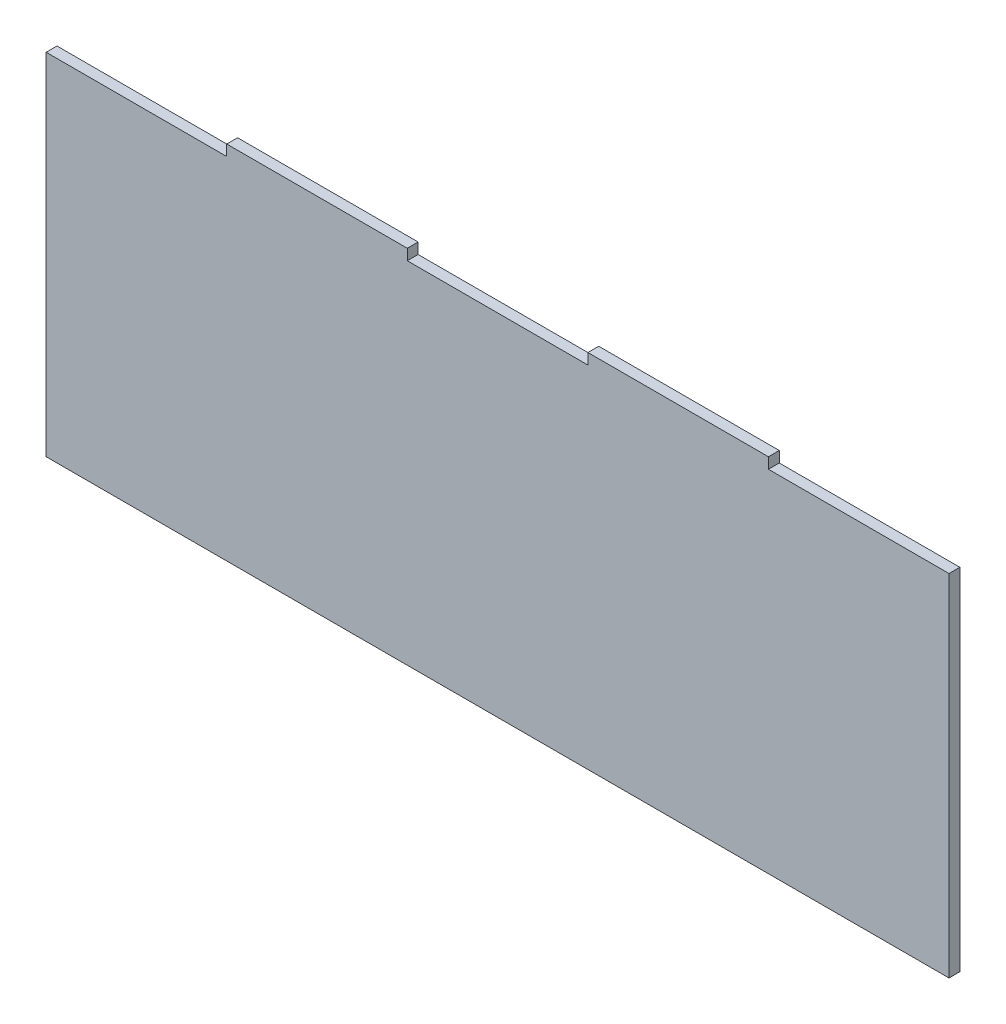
ISO-10303-21;
HEADER;
FILE_DESCRIPTION(('STEP AP214'),'2;1');
FILE_NAME('part.step','',(''),(''),'','','');
FILE_SCHEMA(('AUTOMOTIVE_DESIGN { 1 0 10303 214 1 1 1 1 }'));
ENDSEC;
DATA;
#1=APPLICATION_CONTEXT('core data for automotive mechanical design processes');
#2=APPLICATION_PROTOCOL_DEFINITION('international standard','automotive_design',2000,#1);
#3=PRODUCT_CONTEXT('',#1,'mechanical');
#4=PRODUCT('Part','Part','',(#3));
#5=PRODUCT_RELATED_PRODUCT_CATEGORY('part','',(#4));
#6=PRODUCT_DEFINITION_FORMATION('','',#4);
#7=PRODUCT_DEFINITION_CONTEXT('part definition',#1,'design');
#8=PRODUCT_DEFINITION('design','',#6,#7);
#9=PRODUCT_DEFINITION_SHAPE('','',#8);
#10=(LENGTH_UNIT() NAMED_UNIT(*) SI_UNIT(.MILLI.,.METRE.));
#11=(NAMED_UNIT(*) PLANE_ANGLE_UNIT() SI_UNIT($,.RADIAN.));
#12=(NAMED_UNIT(*) SI_UNIT($,.STERADIAN.) SOLID_ANGLE_UNIT());
#13=UNCERTAINTY_MEASURE_WITH_UNIT(LENGTH_MEASURE(1.E-05),#10,'distance_accuracy_value','');
#14=(GEOMETRIC_REPRESENTATION_CONTEXT(3) GLOBAL_UNCERTAINTY_ASSIGNED_CONTEXT((#13)) GLOBAL_UNIT_ASSIGNED_CONTEXT((#10,
#11,#12)) REPRESENTATION_CONTEXT('',''));
#15=CARTESIAN_POINT('',(0.,0.,0.));
#16=DIRECTION('',(0.,0.,1.));
#17=DIRECTION('',(1.,0.,0.));
#18=AXIS2_PLACEMENT_3D('',#15,#16,#17);
#19=CARTESIAN_POINT('',(-116.914191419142,267.927392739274,6.));
#20=DIRECTION('',(0.,1.,0.));
#21=DIRECTION('',(0.,0.,1.));
#22=AXIS2_PLACEMENT_3D('',#19,#20,#21);
#23=PLANE('',#22);
#24=DIRECTION('',(1.,0.,0.));
#25=VECTOR('',#24,1.);
#26=CARTESIAN_POINT('',(-116.914191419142,267.927392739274,0.));
#27=LINE('',#26,#25);
#28=CARTESIAN_POINT('',(-116.914191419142,267.927392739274,0.));
#29=VERTEX_POINT('',#28);
#30=CARTESIAN_POINT('',(-16.914191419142,267.927392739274,0.));
#31=VERTEX_POINT('',#30);
#32=EDGE_CURVE('E152',#29,#31,#27,.T.);
#33=ORIENTED_EDGE('',*,*,#32,.F.);
#34=DIRECTION('',(0.,0.,-1.));
#35=VECTOR('',#34,1.);
#36=CARTESIAN_POINT('',(-116.914191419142,267.927392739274,6.));
#37=LINE('',#36,#35);
#38=CARTESIAN_POINT('',(-116.914191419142,267.927392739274,6.));
#39=VERTEX_POINT('',#38);
#40=EDGE_CURVE('E11',#39,#29,#37,.T.);
#41=ORIENTED_EDGE('',*,*,#40,.F.);
#42=DIRECTION('',(1.,0.,0.));
#43=VECTOR('',#42,1.);
#44=CARTESIAN_POINT('',(-116.914191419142,267.927392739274,6.));
#45=LINE('',#44,#43);
#46=CARTESIAN_POINT('',(-16.914191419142,267.927392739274,6.));
#47=VERTEX_POINT('',#46);
#48=EDGE_CURVE('E183',#39,#47,#45,.T.);
#49=ORIENTED_EDGE('',*,*,#48,.T.);
#50=DIRECTION('',(0.,0.,-1.));
#51=VECTOR('',#50,1.);
#52=CARTESIAN_POINT('',(-16.914191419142,267.927392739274,6.));
#53=LINE('',#52,#51);
#54=EDGE_CURVE('E36',#47,#31,#53,.T.);
#55=ORIENTED_EDGE('',*,*,#54,.T.);
#56=EDGE_LOOP('',(#33,#41,#49,#55));
#57=FACE_BOUND('',#56,.T.);
#58=ADVANCED_FACE('F33',(#57),#23,.T.);
#59=CARTESIAN_POINT('',(-116.914191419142,273.927392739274,6.));
#60=DIRECTION('',(1.,0.,0.));
#61=DIRECTION('',(0.,1.,0.));
#62=AXIS2_PLACEMENT_3D('',#59,#60,#61);
#63=PLANE('',#62);
#64=DIRECTION('',(0.,-1.,0.));
#65=VECTOR('',#64,1.);
#66=CARTESIAN_POINT('',(-116.914191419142,273.927392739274,0.));
#67=LINE('',#66,#65);
#68=CARTESIAN_POINT('',(-116.914191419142,273.927392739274,0.));
#69=VERTEX_POINT('',#68);
#70=EDGE_CURVE('E181',#69,#29,#67,.T.);
#71=ORIENTED_EDGE('',*,*,#70,.F.);
#72=DIRECTION('',(0.,0.,-1.));
#73=VECTOR('',#72,1.);
#74=CARTESIAN_POINT('',(-116.914191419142,273.927392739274,6.));
#75=LINE('',#74,#73);
#76=CARTESIAN_POINT('',(-116.914191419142,273.927392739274,6.));
#77=VERTEX_POINT('',#76);
#78=EDGE_CURVE('E42',#77,#69,#75,.T.);
#79=ORIENTED_EDGE('',*,*,#78,.F.);
#80=DIRECTION('',(0.,-1.,0.));
#81=VECTOR('',#80,1.);
#82=CARTESIAN_POINT('',(-116.914191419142,273.927392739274,6.));
#83=LINE('',#82,#81);
#84=EDGE_CURVE('E147',#77,#39,#83,.T.);
#85=ORIENTED_EDGE('',*,*,#84,.T.);
#86=ORIENTED_EDGE('',*,*,#40,.T.);
#87=EDGE_LOOP('',(#71,#79,#85,#86));
#88=FACE_BOUND('',#87,.T.);
#89=ADVANCED_FACE('F205',(#88),#63,.T.);
#90=CARTESIAN_POINT('',(-216.914191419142,273.927392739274,6.));
#91=DIRECTION('',(0.,1.,0.));
#92=DIRECTION('',(0.,0.,1.));
#93=AXIS2_PLACEMENT_3D('',#90,#91,#92);
#94=PLANE('',#93);
#95=DIRECTION('',(1.,0.,0.));
#96=VECTOR('',#95,1.);
#97=CARTESIAN_POINT('',(-216.914191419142,273.927392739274,0.));
#98=LINE('',#97,#96);
#99=CARTESIAN_POINT('',(-216.914191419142,273.927392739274,0.));
#100=VERTEX_POINT('',#99);
#101=EDGE_CURVE('E132',#100,#69,#98,.T.);
#102=ORIENTED_EDGE('',*,*,#101,.F.);
#103=DIRECTION('',(0.,0.,-1.));
#104=VECTOR('',#103,1.);
#105=CARTESIAN_POINT('',(-216.914191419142,273.927392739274,6.));
#106=LINE('',#105,#104);
#107=CARTESIAN_POINT('',(-216.914191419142,273.927392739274,6.));
#108=VERTEX_POINT('',#107);
#109=EDGE_CURVE('E126',#108,#100,#106,.T.);
#110=ORIENTED_EDGE('',*,*,#109,.F.);
#111=DIRECTION('',(1.,0.,0.));
#112=VECTOR('',#111,1.);
#113=CARTESIAN_POINT('',(-216.914191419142,273.927392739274,6.));
#114=LINE('',#113,#112);
#115=EDGE_CURVE('E130',#108,#77,#114,.T.);
#116=ORIENTED_EDGE('',*,*,#115,.T.);
#117=ORIENTED_EDGE('',*,*,#78,.T.);
#118=EDGE_LOOP('',(#102,#110,#116,#117));
#119=FACE_BOUND('',#118,.T.);
#120=ADVANCED_FACE('F128',(#119),#94,.T.);
#121=CARTESIAN_POINT('',(-216.914191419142,273.927392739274,6.));
#122=DIRECTION('',(1.,0.,0.));
#123=DIRECTION('',(0.,0.,-1.));
#124=AXIS2_PLACEMENT_3D('',#121,#122,#123);
#125=PLANE('',#124);
#126=DIRECTION('',(0.,-1.,0.));
#127=VECTOR('',#126,1.);
#128=CARTESIAN_POINT('',(-216.914191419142,273.927392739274,0.));
#129=LINE('',#128,#127);
#130=CARTESIAN_POINT('',(-216.914191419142,267.927392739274,0.));
#131=VERTEX_POINT('',#130);
#132=EDGE_CURVE('E178',#100,#131,#129,.T.);
#133=ORIENTED_EDGE('',*,*,#132,.T.);
#134=DIRECTION('',(0.,0.,-1.));
#135=VECTOR('',#134,1.);
#136=CARTESIAN_POINT('',(-216.914191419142,267.927392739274,6.));
#137=LINE('',#136,#135);
#138=CARTESIAN_POINT('',(-216.914191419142,267.927392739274,6.));
#139=VERTEX_POINT('',#138);
#140=EDGE_CURVE('E136',#139,#131,#137,.T.);
#141=ORIENTED_EDGE('',*,*,#140,.F.);
#142=DIRECTION('',(0.,-1.,0.));
#143=VECTOR('',#142,1.);
#144=CARTESIAN_POINT('',(-216.914191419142,273.927392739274,6.));
#145=LINE('',#144,#143);
#146=EDGE_CURVE('E139',#108,#139,#145,.T.);
#147=ORIENTED_EDGE('',*,*,#146,.F.);
#148=ORIENTED_EDGE('',*,*,#109,.T.);
#149=EDGE_LOOP('',(#133,#141,#147,#148));
#150=FACE_BOUND('',#149,.T.);
#151=ADVANCED_FACE('F140',(#150),#125,.F.);
#152=CARTESIAN_POINT('',(-316.914191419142,267.927392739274,6.));
#153=DIRECTION('',(0.,1.,0.));
#154=DIRECTION('',(0.,0.,1.));
#155=AXIS2_PLACEMENT_3D('',#152,#153,#154);
#156=PLANE('',#155);
#157=DIRECTION('',(1.,0.,0.));
#158=VECTOR('',#157,1.);
#159=CARTESIAN_POINT('',(-316.914191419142,267.927392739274,0.));
#160=LINE('',#159,#158);
#161=CARTESIAN_POINT('',(-316.914191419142,267.927392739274,0.));
#162=VERTEX_POINT('',#161);
#163=EDGE_CURVE('E175',#162,#131,#160,.T.);
#164=ORIENTED_EDGE('',*,*,#163,.F.);
#165=DIRECTION('',(0.,0.,-1.));
#166=VECTOR('',#165,1.);
#167=CARTESIAN_POINT('',(-316.914191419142,267.927392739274,6.));
#168=LINE('',#167,#166);
#169=CARTESIAN_POINT('',(-316.914191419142,267.927392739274,6.));
#170=VERTEX_POINT('',#169);
#171=EDGE_CURVE('E187',#170,#162,#168,.T.);
#172=ORIENTED_EDGE('',*,*,#171,.F.);
#173=DIRECTION('',(1.,0.,0.));
#174=VECTOR('',#173,1.);
#175=CARTESIAN_POINT('',(-316.914191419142,267.927392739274,6.));
#176=LINE('',#175,#174);
#177=EDGE_CURVE('E144',#170,#139,#176,.T.);
#178=ORIENTED_EDGE('',*,*,#177,.T.);
#179=ORIENTED_EDGE('',*,*,#140,.T.);
#180=EDGE_LOOP('',(#164,#172,#178,#179));
#181=FACE_BOUND('',#180,.T.);
#182=ADVANCED_FACE('F218',(#181),#156,.T.);
#183=CARTESIAN_POINT('',(-316.914191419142,273.927392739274,6.));
#184=DIRECTION('',(1.,0.,0.));
#185=DIRECTION('',(0.,0.,-1.));
#186=AXIS2_PLACEMENT_3D('',#183,#184,#185);
#187=PLANE('',#186);
#188=DIRECTION('',(0.,-1.,0.));
#189=VECTOR('',#188,1.);
#190=CARTESIAN_POINT('',(-316.914191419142,273.927392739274,0.));
#191=LINE('',#190,#189);
#192=CARTESIAN_POINT('',(-316.914191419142,273.927392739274,0.));
#193=VERTEX_POINT('',#192);
#194=EDGE_CURVE('E172',#193,#162,#191,.T.);
#195=ORIENTED_EDGE('',*,*,#194,.F.);
#196=DIRECTION('',(0.,0.,-1.));
#197=VECTOR('',#196,1.);
#198=CARTESIAN_POINT('',(-316.914191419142,273.927392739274,6.));
#199=LINE('',#198,#197);
#200=CARTESIAN_POINT('',(-316.914191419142,273.927392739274,6.));
#201=VERTEX_POINT('',#200);
#202=EDGE_CURVE('E189',#201,#193,#199,.T.);
#203=ORIENTED_EDGE('',*,*,#202,.F.);
#204=DIRECTION('',(0.,-1.,0.));
#205=VECTOR('',#204,1.);
#206=CARTESIAN_POINT('',(-316.914191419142,273.927392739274,6.));
#207=LINE('',#206,#205);
#208=EDGE_CURVE('E349',#201,#170,#207,.T.);
#209=ORIENTED_EDGE('',*,*,#208,.T.);
#210=ORIENTED_EDGE('',*,*,#171,.T.);
#211=EDGE_LOOP('',(#195,#203,#209,#210));
#212=FACE_BOUND('',#211,.T.);
#213=ADVANCED_FACE('F221',(#212),#187,.T.);
#214=CARTESIAN_POINT('',(-416.914191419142,273.927392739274,6.));
#215=DIRECTION('',(0.,1.,0.));
#216=DIRECTION('',(0.,0.,1.));
#217=AXIS2_PLACEMENT_3D('',#214,#215,#216);
#218=PLANE('',#217);
#219=DIRECTION('',(1.,0.,0.));
#220=VECTOR('',#219,1.);
#221=CARTESIAN_POINT('',(-416.914191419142,273.927392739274,0.));
#222=LINE('',#221,#220);
#223=CARTESIAN_POINT('',(-416.914191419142,273.927392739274,0.));
#224=VERTEX_POINT('',#223);
#225=EDGE_CURVE('E169',#224,#193,#222,.T.);
#226=ORIENTED_EDGE('',*,*,#225,.F.);
#227=DIRECTION('',(0.,0.,-1.));
#228=VECTOR('',#227,1.);
#229=CARTESIAN_POINT('',(-416.914191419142,273.927392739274,6.));
#230=LINE('',#229,#228);
#231=CARTESIAN_POINT('',(-416.914191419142,273.927392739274,6.));
#232=VERTEX_POINT('',#231);
#233=EDGE_CURVE('E191',#232,#224,#230,.T.);
#234=ORIENTED_EDGE('',*,*,#233,.F.);
#235=DIRECTION('',(1.,0.,0.));
#236=VECTOR('',#235,1.);
#237=CARTESIAN_POINT('',(-416.914191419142,273.927392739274,6.));
#238=LINE('',#237,#236);
#239=EDGE_CURVE('E345',#232,#201,#238,.T.);
#240=ORIENTED_EDGE('',*,*,#239,.T.);
#241=ORIENTED_EDGE('',*,*,#202,.T.);
#242=EDGE_LOOP('',(#226,#234,#240,#241));
#243=FACE_BOUND('',#242,.T.);
#244=ADVANCED_FACE('F225',(#243),#218,.T.);
#245=CARTESIAN_POINT('',(-416.914191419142,273.927392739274,6.));
#246=DIRECTION('',(1.,0.,0.));
#247=DIRECTION('',(0.,0.,-1.));
#248=AXIS2_PLACEMENT_3D('',#245,#246,#247);
#249=PLANE('',#248);
#250=DIRECTION('',(0.,-1.,0.));
#251=VECTOR('',#250,1.);
#252=CARTESIAN_POINT('',(-416.914191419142,273.927392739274,0.));
#253=LINE('',#252,#251);
#254=CARTESIAN_POINT('',(-416.914191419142,267.927392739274,0.));
#255=VERTEX_POINT('',#254);
#256=EDGE_CURVE('E166',#224,#255,#253,.T.);
#257=ORIENTED_EDGE('',*,*,#256,.T.);
#258=DIRECTION('',(0.,0.,-1.));
#259=VECTOR('',#258,1.);
#260=CARTESIAN_POINT('',(-416.914191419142,267.927392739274,6.));
#261=LINE('',#260,#259);
#262=CARTESIAN_POINT('',(-416.914191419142,267.927392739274,6.));
#263=VERTEX_POINT('',#262);
#264=EDGE_CURVE('E193',#263,#255,#261,.T.);
#265=ORIENTED_EDGE('',*,*,#264,.F.);
#266=DIRECTION('',(0.,-1.,0.));
#267=VECTOR('',#266,1.);
#268=CARTESIAN_POINT('',(-416.914191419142,273.927392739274,6.));
#269=LINE('',#268,#267);
#270=EDGE_CURVE('E353',#232,#263,#269,.T.);
#271=ORIENTED_EDGE('',*,*,#270,.F.);
#272=ORIENTED_EDGE('',*,*,#233,.T.);
#273=EDGE_LOOP('',(#257,#265,#271,#272));
#274=FACE_BOUND('',#273,.T.);
#275=ADVANCED_FACE('F229',(#274),#249,.F.);
#276=CARTESIAN_POINT('',(-516.914191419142,267.927392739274,6.));
#277=DIRECTION('',(0.,1.,0.));
#278=DIRECTION('',(0.,0.,1.));
#279=AXIS2_PLACEMENT_3D('',#276,#277,#278);
#280=PLANE('',#279);
#281=DIRECTION('',(1.,0.,0.));
#282=VECTOR('',#281,1.);
#283=CARTESIAN_POINT('',(-516.914191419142,267.927392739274,0.));
#284=LINE('',#283,#282);
#285=CARTESIAN_POINT('',(-516.914191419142,267.927392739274,0.));
#286=VERTEX_POINT('',#285);
#287=EDGE_CURVE('E163',#286,#255,#284,.T.);
#288=ORIENTED_EDGE('',*,*,#287,.F.);
#289=DIRECTION('',(0.,0.,-1.));
#290=VECTOR('',#289,1.);
#291=CARTESIAN_POINT('',(-516.914191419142,267.927392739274,6.));
#292=LINE('',#291,#290);
#293=CARTESIAN_POINT('',(-516.914191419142,267.927392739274,6.));
#294=VERTEX_POINT('',#293);
#295=EDGE_CURVE('E195',#294,#286,#292,.T.);
#296=ORIENTED_EDGE('',*,*,#295,.F.);
#297=DIRECTION('',(1.,0.,0.));
#298=VECTOR('',#297,1.);
#299=CARTESIAN_POINT('',(-516.914191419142,267.927392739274,6.));
#300=LINE('',#299,#298);
#301=EDGE_CURVE('E339',#294,#263,#300,.T.);
#302=ORIENTED_EDGE('',*,*,#301,.T.);
#303=ORIENTED_EDGE('',*,*,#264,.T.);
#304=EDGE_LOOP('',(#288,#296,#302,#303));
#305=FACE_BOUND('',#304,.T.);
#306=ADVANCED_FACE('F233',(#305),#280,.T.);
#307=CARTESIAN_POINT('',(-516.914191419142,267.927392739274,6.));
#308=DIRECTION('',(1.,0.,0.));
#309=DIRECTION('',(0.,0.,-1.));
#310=AXIS2_PLACEMENT_3D('',#307,#308,#309);
#311=PLANE('',#310);
#312=DIRECTION('',(0.,-1.,0.));
#313=VECTOR('',#312,1.);
#314=CARTESIAN_POINT('',(-516.914191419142,267.927392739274,0.));
#315=LINE('',#314,#313);
#316=CARTESIAN_POINT('',(-516.914191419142,73.9273927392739,0.));
#317=VERTEX_POINT('',#316);
#318=EDGE_CURVE('E161',#286,#317,#315,.T.);
#319=ORIENTED_EDGE('',*,*,#318,.T.);
#320=DIRECTION('',(0.,0.,-1.));
#321=VECTOR('',#320,1.);
#322=CARTESIAN_POINT('',(-516.914191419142,73.9273927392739,6.));
#323=LINE('',#322,#321);
#324=CARTESIAN_POINT('',(-516.914191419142,73.9273927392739,6.));
#325=VERTEX_POINT('',#324);
#326=EDGE_CURVE('E197',#325,#317,#323,.T.);
#327=ORIENTED_EDGE('',*,*,#326,.F.);
#328=DIRECTION('',(0.,-1.,0.));
#329=VECTOR('',#328,1.);
#330=CARTESIAN_POINT('',(-516.914191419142,267.927392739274,6.));
#331=LINE('',#330,#329);
#332=EDGE_CURVE('E356',#294,#325,#331,.T.);
#333=ORIENTED_EDGE('',*,*,#332,.F.);
#334=ORIENTED_EDGE('',*,*,#295,.T.);
#335=EDGE_LOOP('',(#319,#327,#333,#334));
#336=FACE_BOUND('',#335,.T.);
#337=ADVANCED_FACE('F237',(#336),#311,.F.);
#338=CARTESIAN_POINT('',(-516.914191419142,73.9273927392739,6.));
#339=DIRECTION('',(0.,1.,0.));
#340=DIRECTION('',(0.,0.,1.));
#341=AXIS2_PLACEMENT_3D('',#338,#339,#340);
#342=PLANE('',#341);
#343=DIRECTION('',(1.,0.,0.));
#344=VECTOR('',#343,1.);
#345=CARTESIAN_POINT('',(-516.914191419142,73.9273927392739,0.));
#346=LINE('',#345,#344);
#347=CARTESIAN_POINT('',(-16.914191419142,73.9273927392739,0.));
#348=VERTEX_POINT('',#347);
#349=EDGE_CURVE('E158',#317,#348,#346,.T.);
#350=ORIENTED_EDGE('',*,*,#349,.T.);
#351=DIRECTION('',(0.,0.,-1.));
#352=VECTOR('',#351,1.);
#353=CARTESIAN_POINT('',(-16.914191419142,73.9273927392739,6.));
#354=LINE('',#353,#352);
#355=CARTESIAN_POINT('',(-16.914191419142,73.9273927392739,6.));
#356=VERTEX_POINT('',#355);
#357=EDGE_CURVE('E199',#356,#348,#354,.T.);
#358=ORIENTED_EDGE('',*,*,#357,.F.);
#359=DIRECTION('',(1.,0.,0.));
#360=VECTOR('',#359,1.);
#361=CARTESIAN_POINT('',(-516.914191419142,73.9273927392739,6.));
#362=LINE('',#361,#360);
#363=EDGE_CURVE('E358',#325,#356,#362,.T.);
#364=ORIENTED_EDGE('',*,*,#363,.F.);
#365=ORIENTED_EDGE('',*,*,#326,.T.);
#366=EDGE_LOOP('',(#350,#358,#364,#365));
#367=FACE_BOUND('',#366,.T.);
#368=ADVANCED_FACE('F241',(#367),#342,.F.);
#369=CARTESIAN_POINT('',(-16.914191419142,267.927392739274,6.));
#370=DIRECTION('',(1.,0.,0.));
#371=DIRECTION('',(0.,1.,0.));
#372=AXIS2_PLACEMENT_3D('',#369,#370,#371);
#373=PLANE('',#372);
#374=DIRECTION('',(0.,-1.,0.));
#375=VECTOR('',#374,1.);
#376=CARTESIAN_POINT('',(-16.914191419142,267.927392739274,0.));
#377=LINE('',#376,#375);
#378=EDGE_CURVE('E155',#31,#348,#377,.T.);
#379=ORIENTED_EDGE('',*,*,#378,.F.);
#380=ORIENTED_EDGE('',*,*,#54,.F.);
#381=DIRECTION('',(0.,-1.,0.));
#382=VECTOR('',#381,1.);
#383=CARTESIAN_POINT('',(-16.914191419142,267.927392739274,6.));
#384=LINE('',#383,#382);
#385=EDGE_CURVE('E360',#47,#356,#384,.T.);
#386=ORIENTED_EDGE('',*,*,#385,.T.);
#387=ORIENTED_EDGE('',*,*,#357,.T.);
#388=EDGE_LOOP('',(#379,#380,#386,#387));
#389=FACE_BOUND('',#388,.T.);
#390=ADVANCED_FACE('F201',(#389),#373,.T.);
#391=CARTESIAN_POINT('',(0.,0.,6.));
#392=DIRECTION('',(0.,0.,-1.));
#393=DIRECTION('',(-1.,0.,0.));
#394=AXIS2_PLACEMENT_3D('',#391,#392,#393);
#395=PLANE('',#394);
#396=ORIENTED_EDGE('',*,*,#48,.F.);
#397=ORIENTED_EDGE('',*,*,#84,.F.);
#398=ORIENTED_EDGE('',*,*,#115,.F.);
#399=ORIENTED_EDGE('',*,*,#146,.T.);
#400=ORIENTED_EDGE('',*,*,#177,.F.);
#401=ORIENTED_EDGE('',*,*,#208,.F.);
#402=ORIENTED_EDGE('',*,*,#239,.F.);
#403=ORIENTED_EDGE('',*,*,#270,.T.);
#404=ORIENTED_EDGE('',*,*,#301,.F.);
#405=ORIENTED_EDGE('',*,*,#332,.T.);
#406=ORIENTED_EDGE('',*,*,#363,.T.);
#407=ORIENTED_EDGE('',*,*,#385,.F.);
#408=EDGE_LOOP('',(#396,#397,#398,#399,#400,#401,#402,#403,#404,#405,#406,#407));
#409=FACE_BOUND('',#408,.T.);
#410=ADVANCED_FACE('F146',(#409),#395,.F.);
#411=CARTESIAN_POINT('',(0.,0.,0.));
#412=DIRECTION('',(0.,0.,-1.));
#413=DIRECTION('',(-1.,0.,0.));
#414=AXIS2_PLACEMENT_3D('',#411,#412,#413);
#415=PLANE('',#414);
#416=ORIENTED_EDGE('',*,*,#32,.T.);
#417=ORIENTED_EDGE('',*,*,#378,.T.);
#418=ORIENTED_EDGE('',*,*,#349,.F.);
#419=ORIENTED_EDGE('',*,*,#318,.F.);
#420=ORIENTED_EDGE('',*,*,#287,.T.);
#421=ORIENTED_EDGE('',*,*,#256,.F.);
#422=ORIENTED_EDGE('',*,*,#225,.T.);
#423=ORIENTED_EDGE('',*,*,#194,.T.);
#424=ORIENTED_EDGE('',*,*,#163,.T.);
#425=ORIENTED_EDGE('',*,*,#132,.F.);
#426=ORIENTED_EDGE('',*,*,#101,.T.);
#427=ORIENTED_EDGE('',*,*,#70,.T.);
#428=EDGE_LOOP('',(#416,#417,#418,#419,#420,#421,#422,#423,#424,#425,#426,#427));
#429=FACE_BOUND('',#428,.T.);
#430=ADVANCED_FACE('F204',(#429),#415,.T.);
#431=CLOSED_SHELL('',(#58,#89,#120,#151,#182,#213,#244,#275,#306,#337,#368,#390,#410,#430));
#432=MANIFOLD_SOLID_BREP('B2',#431);
#433=ADVANCED_BREP_SHAPE_REPRESENTATION('',(#18,#432),#14);
#434=SHAPE_DEFINITION_REPRESENTATION(#9,#433);
ENDSEC;
END-ISO-10303-21;
